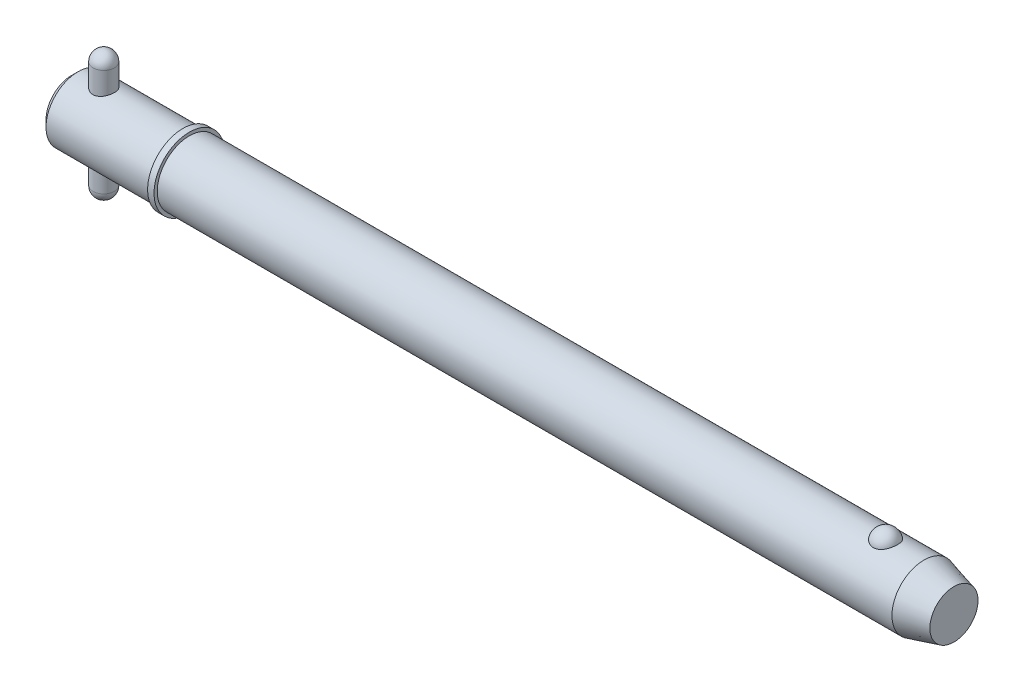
ISO-10303-21;
HEADER;
FILE_DESCRIPTION(('STEP AP214'),'2;1');
FILE_NAME('part.step','',(''),(''),'','','');
FILE_SCHEMA(('AUTOMOTIVE_DESIGN { 1 0 10303 214 1 1 1 1 }'));
ENDSEC;
DATA;
#1=APPLICATION_CONTEXT('core data for automotive mechanical design processes');
#2=APPLICATION_PROTOCOL_DEFINITION('international standard','automotive_design',2000,#1);
#3=PRODUCT_CONTEXT('',#1,'mechanical');
#4=PRODUCT('Part','Part','',(#3));
#5=PRODUCT_RELATED_PRODUCT_CATEGORY('part','',(#4));
#6=PRODUCT_DEFINITION_FORMATION('','',#4);
#7=PRODUCT_DEFINITION_CONTEXT('part definition',#1,'design');
#8=PRODUCT_DEFINITION('design','',#6,#7);
#9=PRODUCT_DEFINITION_SHAPE('','',#8);
#10=(LENGTH_UNIT() NAMED_UNIT(*) SI_UNIT(.MILLI.,.METRE.));
#11=(NAMED_UNIT(*) PLANE_ANGLE_UNIT() SI_UNIT($,.RADIAN.));
#12=(NAMED_UNIT(*) SI_UNIT($,.STERADIAN.) SOLID_ANGLE_UNIT());
#13=UNCERTAINTY_MEASURE_WITH_UNIT(LENGTH_MEASURE(1.E-05),#10,'distance_accuracy_value','');
#14=(GEOMETRIC_REPRESENTATION_CONTEXT(3) GLOBAL_UNCERTAINTY_ASSIGNED_CONTEXT((#13)) GLOBAL_UNIT_ASSIGNED_CONTEXT((#10,
#11,#12)) REPRESENTATION_CONTEXT('',''));
#15=CARTESIAN_POINT('',(0.,0.,0.));
#16=DIRECTION('',(0.,0.,1.));
#17=DIRECTION('',(1.,0.,0.));
#18=AXIS2_PLACEMENT_3D('',#15,#16,#17);
#19=CARTESIAN_POINT('',(9.525,19.05,0.));
#20=DIRECTION('',(0.,-1.,0.));
#21=DIRECTION('',(0.,0.,-1.));
#22=AXIS2_PLACEMENT_3D('',#19,#20,#21);
#23=CYLINDRICAL_SURFACE('',#22,3.175);
#24=CARTESIAN_POINT('',(9.525,-15.875,0.));
#25=DIRECTION('',(0.,-1.,0.));
#26=DIRECTION('',(0.,0.,-1.));
#27=AXIS2_PLACEMENT_3D('',#24,#25,#26);
#28=CIRCLE('',#27,3.175);
#29=CARTESIAN_POINT('',(9.525,-15.875,-3.175));
#30=VERTEX_POINT('',#29);
#31=EDGE_CURVE('P0_E10',#30,#30,#28,.F.);
#32=CARTESIAN_POINT('',(9.525,15.875,0.));
#33=DIRECTION('',(0.,-1.,0.));
#34=DIRECTION('',(0.,0.,-1.));
#35=AXIS2_PLACEMENT_3D('',#32,#33,#34);
#36=CIRCLE('',#35,3.175);
#37=CARTESIAN_POINT('',(9.525,15.875,-3.175));
#38=VERTEX_POINT('',#37);
#39=EDGE_CURVE('P0_E21',#38,#38,#36,.T.);
#40=CARTESIAN_POINT('',(9.525,-15.875,-3.175));
#41=CARTESIAN_POINT('',(9.525,-15.5442708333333,-3.175));
#42=CARTESIAN_POINT('',(9.525,-15.2135416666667,-3.175));
#43=CARTESIAN_POINT('',(9.525,-14.5520833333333,-3.175));
#44=CARTESIAN_POINT('',(9.525,-14.2213541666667,-3.175));
#45=CARTESIAN_POINT('',(9.525,-13.5598958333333,-3.175));
#46=CARTESIAN_POINT('',(9.525,-13.2291666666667,-3.175));
#47=CARTESIAN_POINT('',(9.525,-12.5677083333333,-3.175));
#48=CARTESIAN_POINT('',(9.525,-12.2369791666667,-3.175));
#49=CARTESIAN_POINT('',(9.525,-11.5755208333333,-3.175));
#50=CARTESIAN_POINT('',(9.525,-11.2447916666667,-3.175));
#51=CARTESIAN_POINT('',(9.525,-10.5833333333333,-3.175));
#52=CARTESIAN_POINT('',(9.525,-10.2526041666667,-3.175));
#53=CARTESIAN_POINT('',(9.525,-9.59114583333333,-3.175));
#54=CARTESIAN_POINT('',(9.525,-9.26041666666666,-3.175));
#55=CARTESIAN_POINT('',(9.525,-8.59895833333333,-3.175));
#56=CARTESIAN_POINT('',(9.525,-8.26822916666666,-3.175));
#57=CARTESIAN_POINT('',(9.525,-7.60677083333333,-3.175));
#58=CARTESIAN_POINT('',(9.525,-7.27604166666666,-3.175));
#59=CARTESIAN_POINT('',(9.525,-6.61458333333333,-3.175));
#60=CARTESIAN_POINT('',(9.525,-6.28385416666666,-3.175));
#61=CARTESIAN_POINT('',(9.525,-5.62239583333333,-3.175));
#62=CARTESIAN_POINT('',(9.525,-5.29166666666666,-3.175));
#63=CARTESIAN_POINT('',(9.525,-4.63020833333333,-3.175));
#64=CARTESIAN_POINT('',(9.525,-4.29947916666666,-3.175));
#65=CARTESIAN_POINT('',(9.525,-3.63802083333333,-3.175));
#66=CARTESIAN_POINT('',(9.525,-3.30729166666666,-3.175));
#67=CARTESIAN_POINT('',(9.525,-2.64583333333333,-3.175));
#68=CARTESIAN_POINT('',(9.525,-2.31510416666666,-3.175));
#69=CARTESIAN_POINT('',(9.525,-1.65364583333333,-3.175));
#70=CARTESIAN_POINT('',(9.525,-1.32291666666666,-3.175));
#71=CARTESIAN_POINT('',(9.525,-0.661458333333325,-3.175));
#72=CARTESIAN_POINT('',(9.525,-0.330729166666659,-3.175));
#73=CARTESIAN_POINT('',(9.525,0.330729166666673,-3.175));
#74=CARTESIAN_POINT('',(9.525,0.661458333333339,-3.175));
#75=CARTESIAN_POINT('',(9.525,1.32291666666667,-3.175));
#76=CARTESIAN_POINT('',(9.525,1.65364583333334,-3.175));
#77=CARTESIAN_POINT('',(9.525,2.31510416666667,-3.175));
#78=CARTESIAN_POINT('',(9.525,2.64583333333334,-3.175));
#79=CARTESIAN_POINT('',(9.525,3.30729166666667,-3.175));
#80=CARTESIAN_POINT('',(9.525,3.63802083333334,-3.175));
#81=CARTESIAN_POINT('',(9.525,4.29947916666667,-3.175));
#82=CARTESIAN_POINT('',(9.525,4.63020833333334,-3.175));
#83=CARTESIAN_POINT('',(9.525,5.29166666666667,-3.175));
#84=CARTESIAN_POINT('',(9.525,5.62239583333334,-3.175));
#85=CARTESIAN_POINT('',(9.525,6.28385416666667,-3.175));
#86=CARTESIAN_POINT('',(9.525,6.61458333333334,-3.175));
#87=CARTESIAN_POINT('',(9.525,7.27604166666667,-3.175));
#88=CARTESIAN_POINT('',(9.525,7.60677083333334,-3.175));
#89=CARTESIAN_POINT('',(9.525,8.26822916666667,-3.175));
#90=CARTESIAN_POINT('',(9.525,8.59895833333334,-3.175));
#91=CARTESIAN_POINT('',(9.525,9.26041666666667,-3.175));
#92=CARTESIAN_POINT('',(9.525,9.59114583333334,-3.175));
#93=CARTESIAN_POINT('',(9.525,10.2526041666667,-3.175));
#94=CARTESIAN_POINT('',(9.525,10.5833333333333,-3.175));
#95=CARTESIAN_POINT('',(9.525,11.2447916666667,-3.175));
#96=CARTESIAN_POINT('',(9.525,11.5755208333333,-3.175));
#97=CARTESIAN_POINT('',(9.525,12.2369791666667,-3.175));
#98=CARTESIAN_POINT('',(9.525,12.5677083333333,-3.175));
#99=CARTESIAN_POINT('',(9.525,13.2291666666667,-3.175));
#100=CARTESIAN_POINT('',(9.525,13.5598958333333,-3.175));
#101=CARTESIAN_POINT('',(9.525,14.2213541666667,-3.175));
#102=CARTESIAN_POINT('',(9.525,14.5520833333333,-3.175));
#103=CARTESIAN_POINT('',(9.525,15.2135416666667,-3.175));
#104=CARTESIAN_POINT('',(9.525,15.5442708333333,-3.175));
#105=CARTESIAN_POINT('',(9.525,15.875,-3.175));
#106=B_SPLINE_CURVE_WITH_KNOTS('',3,(#40,#41,#42,#43,#44,#45,#46,#47,#48,#49,#50,#51,#52,#53,
#54,#55,#56,#57,#58,#59,#60,#61,#62,#63,#64,#65,#66,#67,#68,#69,#70,#71,#72,#73,#74,#75,#76,#77,
#78,#79,#80,#81,#82,#83,#84,#85,#86,#87,#88,#89,#90,#91,#92,#93,#94,#95,#96,#97,#98,#99,#100,
#101,#102,#103,#104,#105),.UNSPECIFIED.,.F.,.F.,(4,2,2,2,2,2,2,2,2,2,2,2,2,2,2,2,2,2,2,2,2,2,2,
2,2,2,2,2,2,2,2,2,4),(0.,0.992187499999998,1.984375,2.9765625,3.96875,4.96093749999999,5.953125,
6.9453125,7.9375,8.92968749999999,9.921875,10.9140625,11.90625,12.8984375,13.890625,14.8828125,
15.875,16.8671875,17.859375,18.8515625,19.84375,20.8359375,21.828125,22.8203125,23.8125,
24.8046875,25.796875,26.7890625,27.78125,28.7734375,29.765625,30.7578125,31.75),.UNSPECIFIED.);
#107=EDGE_CURVE('P0_BSEAM14',#30,#38,#106,.T.);
#108=ORIENTED_EDGE('',*,*,#31,.T.);
#109=ORIENTED_EDGE('',*,*,#39,.T.);
#110=ORIENTED_EDGE('',*,*,#107,.T.);
#111=ORIENTED_EDGE('',*,*,#107,.F.);
#112=EDGE_LOOP('',(#108,#110,#109,#111));
#113=FACE_BOUND('',#112,.T.);
#114=ADVANCED_FACE('P0_F14',(#113),#23,.T.);
#115=CARTESIAN_POINT('',(9.525,-15.875,0.));
#116=DIRECTION('',(0.,0.,1.));
#117=DIRECTION('',(1.,0.,0.));
#118=AXIS2_PLACEMENT_3D('',#115,#116,#117);
#119=SPHERICAL_SURFACE('',#118,3.175);
#120=CARTESIAN_POINT('',(9.525,-15.875,0.));
#121=DIRECTION('',(0.,-1.,0.));
#122=DIRECTION('',(0.,0.,-1.));
#123=AXIS2_PLACEMENT_3D('',#120,#121,#122);
#124=SPHERICAL_SURFACE('',#123,3.175);
#125=ORIENTED_EDGE('',*,*,#31,.F.);
#126=EDGE_LOOP('',(#125));
#127=FACE_BOUND('',#126,.T.);
#128=ADVANCED_FACE('P0_F29',(#127),#124,.T.);
#129=CARTESIAN_POINT('',(9.525,15.875,0.));
#130=DIRECTION('',(0.,0.,1.));
#131=DIRECTION('',(1.,0.,0.));
#132=AXIS2_PLACEMENT_3D('',#129,#130,#131);
#133=SPHERICAL_SURFACE('',#132,3.175);
#134=CARTESIAN_POINT('',(9.525,15.875,0.));
#135=DIRECTION('',(0.,-1.,0.));
#136=DIRECTION('',(0.,0.,-1.));
#137=AXIS2_PLACEMENT_3D('',#134,#135,#136);
#138=SPHERICAL_SURFACE('',#137,3.175);
#139=ORIENTED_EDGE('',*,*,#39,.F.);
#140=EDGE_LOOP('',(#139));
#141=FACE_BOUND('',#140,.T.);
#142=ADVANCED_FACE('P0_F16',(#141),#138,.T.);
#143=CLOSED_SHELL('',(#114,#128,#142));
#144=MANIFOLD_SOLID_BREP('P0_B1',#143);
#145=CARTESIAN_POINT('',(0.,0.,0.));
#146=DIRECTION('',(1.,0.,0.));
#147=DIRECTION('',(0.,0.,-1.));
#148=AXIS2_PLACEMENT_3D('',#145,#146,#147);
#149=CYLINDRICAL_SURFACE('',#148,9.525);
#150=CARTESIAN_POINT('',(253.043054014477,0.,0.));
#151=DIRECTION('',(1.,0.,0.));
#152=DIRECTION('',(0.,0.,-1.));
#153=AXIS2_PLACEMENT_3D('',#150,#151,#152);
#154=CIRCLE('',#153,9.525);
#155=CARTESIAN_POINT('',(253.043054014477,0.,-9.525));
#156=VERTEX_POINT('',#155);
#157=EDGE_CURVE('P1_E81',#156,#156,#154,.T.);
#158=ORIENTED_EDGE('',*,*,#157,.F.);
#159=EDGE_LOOP('',(#158));
#160=FACE_BOUND('',#159,.T.);
#161=CARTESIAN_POINT('',(34.93,0.,0.));
#162=DIRECTION('',(1.,0.,0.));
#163=DIRECTION('',(0.,0.,-1.));
#164=AXIS2_PLACEMENT_3D('',#161,#162,#163);
#165=CIRCLE('',#164,9.525);
#166=CARTESIAN_POINT('',(34.93,0.,-9.525));
#167=VERTEX_POINT('',#166);
#168=EDGE_CURVE('P1_E85',#167,#167,#165,.T.);
#169=ORIENTED_EDGE('',*,*,#168,.T.);
#170=EDGE_LOOP('',(#169));
#171=FACE_BOUND('',#170,.T.);
#172=CARTESIAN_POINT('',(241.645757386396,8.80405803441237,3.63513233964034));
#173=CARTESIAN_POINT('',(241.551676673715,8.80405953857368,3.63513053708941));
#174=CARTESIAN_POINT('',(241.457561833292,8.80561325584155,3.63137461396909));
#175=CARTESIAN_POINT('',(241.270012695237,8.81177748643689,3.61638665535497));
#176=CARTESIAN_POINT('',(241.176578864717,8.81638992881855,3.60514990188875));
#177=CARTESIAN_POINT('',(240.897945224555,8.83467114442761,3.56024627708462));
#178=CARTESIAN_POINT('',(240.714691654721,8.85278327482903,3.51538626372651));
#179=CARTESIAN_POINT('',(240.359509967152,8.89871214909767,3.39742145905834));
#180=CARTESIAN_POINT('',(240.187553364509,8.92650327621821,3.32439116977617));
#181=CARTESIAN_POINT('',(239.858707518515,8.98874819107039,3.15220244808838));
#182=CARTESIAN_POINT('',(239.701811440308,9.02319893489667,3.05305594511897));
#183=CARTESIAN_POINT('',(239.402214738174,9.09629186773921,2.82797815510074));
#184=CARTESIAN_POINT('',(239.260060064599,9.13502685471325,2.70135138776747));
#185=CARTESIAN_POINT('',(238.998299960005,9.21186572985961,2.42641932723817));
#186=CARTESIAN_POINT('',(238.878701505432,9.24996941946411,2.2781073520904));
#187=CARTESIAN_POINT('',(238.659645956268,9.32341082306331,1.95652290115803));
#188=CARTESIAN_POINT('',(238.561317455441,9.35855090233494,1.78243511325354));
#189=CARTESIAN_POINT('',(238.393819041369,9.42045142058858,1.41937246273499));
#190=CARTESIAN_POINT('',(238.324651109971,9.44721128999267,1.23039658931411));
#191=CARTESIAN_POINT('',(238.216199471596,9.48990641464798,0.84037088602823));
#192=CARTESIAN_POINT('',(238.177288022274,9.50570658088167,0.639202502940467));
#193=CARTESIAN_POINT('',(238.131555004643,9.52433146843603,0.232664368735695));
#194=CARTESIAN_POINT('',(238.124732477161,9.52715657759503,0.0272947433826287));
#195=CARTESIAN_POINT('',(238.143255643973,9.51956918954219,-0.380478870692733));
#196=CARTESIAN_POINT('',(238.168405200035,9.50923740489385,-0.582893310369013));
#197=CARTESIAN_POINT('',(238.25002537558,9.47651897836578,-0.98029399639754));
#198=CARTESIAN_POINT('',(238.306496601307,9.45413210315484,-1.17528009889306));
#199=CARTESIAN_POINT('',(238.449719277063,9.39954044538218,-1.55263697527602));
#200=CARTESIAN_POINT('',(238.536512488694,9.36732213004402,-1.73498993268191));
#201=CARTESIAN_POINT('',(238.738610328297,9.29640700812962,-2.08177763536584));
#202=CARTESIAN_POINT('',(238.853917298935,9.25770966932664,-2.24621090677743));
#203=CARTESIAN_POINT('',(239.111264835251,9.17775604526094,-2.5533833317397));
#204=CARTESIAN_POINT('',(239.253434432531,9.136488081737,-2.696011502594));
#205=CARTESIAN_POINT('',(239.56089985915,9.05620497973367,-2.95451229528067));
#206=CARTESIAN_POINT('',(239.726193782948,9.01718965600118,-3.07038711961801));
#207=CARTESIAN_POINT('',(240.072052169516,8.94680019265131,-3.26976836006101));
#208=CARTESIAN_POINT('',(240.252227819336,8.91528408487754,-3.35389750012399));
#209=CARTESIAN_POINT('',(240.625651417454,8.86272514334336,-3.49043503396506));
#210=CARTESIAN_POINT('',(240.818894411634,8.84167836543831,-3.54285537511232));
#211=CARTESIAN_POINT('',(241.202503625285,8.81348056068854,-3.61241306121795));
#212=CARTESIAN_POINT('',(241.392525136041,8.80568348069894,-3.6311933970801));
#213=CARTESIAN_POINT('',(241.773190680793,8.80289410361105,-3.63795342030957));
#214=CARTESIAN_POINT('',(241.963834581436,8.80789922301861,-3.62593932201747));
#215=CARTESIAN_POINT('',(242.334007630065,8.82974915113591,-3.57238430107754));
#216=CARTESIAN_POINT('',(242.513697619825,8.84621463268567,-3.53178890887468));
#217=CARTESIAN_POINT('',(242.863422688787,8.88875330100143,-3.42331083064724));
#218=CARTESIAN_POINT('',(243.033456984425,8.91482726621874,-3.35542593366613));
#219=CARTESIAN_POINT('',(243.363237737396,8.97448239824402,-3.19248225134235));
#220=CARTESIAN_POINT('',(243.522680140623,9.00821446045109,-3.0968647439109));
#221=CARTESIAN_POINT('',(243.823513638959,9.07935398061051,-2.88162736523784));
#222=CARTESIAN_POINT('',(243.964900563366,9.11676228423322,-2.76200196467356));
#223=CARTESIAN_POINT('',(244.23331931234,9.19347419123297,-2.49516285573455));
#224=CARTESIAN_POINT('',(244.359275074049,9.23277872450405,-2.34686614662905));
#225=CARTESIAN_POINT('',(244.585522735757,9.3073761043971,-2.03093683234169));
#226=CARTESIAN_POINT('',(244.68581004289,9.34266823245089,-1.86330077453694));
#227=CARTESIAN_POINT('',(244.861514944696,9.40674710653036,-1.50744893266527));
#228=CARTESIAN_POINT('',(244.936041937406,9.43529176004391,-1.31874876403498));
#229=CARTESIAN_POINT('',(245.05416505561,9.48144132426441,-0.930631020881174));
#230=CARTESIAN_POINT('',(245.097760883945,9.49904612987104,-0.731213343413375));
#231=CARTESIAN_POINT('',(245.153158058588,9.5215314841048,-0.327147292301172));
#232=CARTESIAN_POINT('',(245.164935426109,9.52640243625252,-0.122495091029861));
#233=CARTESIAN_POINT('',(245.156382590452,9.5228957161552,0.28601848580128));
#234=CARTESIAN_POINT('',(245.13605305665,9.5145183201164,0.489879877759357));
#235=CARTESIAN_POINT('',(245.063884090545,9.48544083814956,0.889994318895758));
#236=CARTESIAN_POINT('',(245.012199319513,9.46480124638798,1.08627971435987));
#237=CARTESIAN_POINT('',(244.878491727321,9.4133389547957,1.46682086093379));
#238=CARTESIAN_POINT('',(244.796466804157,9.38251554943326,1.65107577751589));
#239=CARTESIAN_POINT('',(244.60319292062,9.31365636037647,2.00346348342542));
#240=CARTESIAN_POINT('',(244.491783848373,9.27558138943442,2.17150083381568));
#241=CARTESIAN_POINT('',(244.242294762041,9.19638714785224,2.48563115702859));
#242=CARTESIAN_POINT('',(244.104216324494,9.15526805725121,2.63172542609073));
#243=CARTESIAN_POINT('',(243.804843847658,9.07465393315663,2.89750997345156));
#244=CARTESIAN_POINT('',(243.643610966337,9.03515496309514,3.01726776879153));
#245=CARTESIAN_POINT('',(243.301613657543,8.96227564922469,3.22732920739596));
#246=CARTESIAN_POINT('',(243.120841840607,8.92889763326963,3.31762165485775));
#247=CARTESIAN_POINT('',(242.751445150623,8.8734538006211,3.46314419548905));
#248=CARTESIAN_POINT('',(242.56332371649,8.85102983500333,3.51950082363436));
#249=CARTESIAN_POINT('',(242.27578699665,8.82666967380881,3.57993683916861));
#250=CARTESIAN_POINT('',(242.179133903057,8.82009725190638,3.59606217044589));
#251=CARTESIAN_POINT('',(241.984677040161,8.81020897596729,3.62022512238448));
#252=CARTESIAN_POINT('',(241.886874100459,8.80689090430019,3.62826825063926));
#253=CARTESIAN_POINT('',(241.741224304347,8.80445615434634,3.63416760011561));
#254=CARTESIAN_POINT('',(241.693495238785,8.80405727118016,3.63513325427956));
#255=CARTESIAN_POINT('',(241.645757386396,8.80405803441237,3.63513233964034));
#256=B_SPLINE_CURVE_WITH_KNOTS('',3,(#172,#173,#174,#175,#176,#177,#178,#179,#180,#181,#182,
#183,#184,#185,#186,#187,#188,#189,#190,#191,#192,#193,#194,#195,#196,#197,#198,#199,#200,#201,
#202,#203,#204,#205,#206,#207,#208,#209,#210,#211,#212,#213,#214,#215,#216,#217,#218,#219,#220,
#221,#222,#223,#224,#225,#226,#227,#228,#229,#230,#231,#232,#233,#234,#235,#236,#237,#238,#239,
#240,#241,#242,#243,#244,#245,#246,#247,#248,#249,#250,#251,#252,#253,#254,#255),.UNSPECIFIED.,
.T.,.F.,(4,2,2,2,2,2,2,2,2,2,2,2,2,2,2,2,2,2,2,2,2,2,2,2,2,2,2,2,2,2,2,2,2,2,2,2,2,2,2,2,2,4),
(0.,0.282202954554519,0.564584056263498,1.13017050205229,1.69427128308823,2.25811483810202,
2.83836627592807,3.41879688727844,4.02497117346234,4.63118665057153,5.24474754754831,
5.85829010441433,6.46808687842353,7.07789545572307,7.68854723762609,8.299249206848,
8.91296283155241,9.52662591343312,10.1275338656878,10.7282152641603,11.2986646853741,
11.8689989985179,12.4213015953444,12.973648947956,13.5380053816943,14.1024919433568,
14.695298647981,15.2882113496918,15.8999469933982,16.5116885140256,17.1238909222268,
17.7360805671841,18.3452748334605,18.9545113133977,19.567138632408,20.179729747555,
20.7907316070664,21.4019653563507,21.9915938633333,22.2859053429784,22.5800161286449,
22.7232098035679),.UNSPECIFIED.);
#257=CARTESIAN_POINT('',(241.645757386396,8.80405803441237,3.63513233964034));
#258=VERTEX_POINT('',#257);
#259=EDGE_CURVE('P1_E35',#258,#258,#256,.T.);
#260=ORIENTED_EDGE('',*,*,#259,.T.);
#261=EDGE_LOOP('',(#260));
#262=FACE_BOUND('',#261,.T.);
#263=ADVANCED_FACE('P1_F13',(#160,#171,#262),#149,.T.);
#264=CARTESIAN_POINT('',(0.,0.,0.));
#265=DIRECTION('',(-1.,0.,0.));
#266=DIRECTION('',(0.,0.,1.));
#267=AXIS2_PLACEMENT_3D('',#264,#265,#266);
#268=PLANE('',#267);
#269=CARTESIAN_POINT('',(0.,0.,0.));
#270=DIRECTION('',(1.,0.,0.));
#271=DIRECTION('',(0.,0.,-1.));
#272=AXIS2_PLACEMENT_3D('',#269,#270,#271);
#273=CIRCLE('',#272,7.62);
#274=CARTESIAN_POINT('',(0.,0.,-7.62));
#275=VERTEX_POINT('',#274);
#276=EDGE_CURVE('P1_E9',#275,#275,#273,.T.);
#277=ORIENTED_EDGE('',*,*,#276,.F.);
#278=EDGE_LOOP('',(#277));
#279=FACE_BOUND('',#278,.T.);
#280=ADVANCED_FACE('P1_F15',(#279),#268,.T.);
#281=CARTESIAN_POINT('',(1.90499999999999,0.,0.));
#282=DIRECTION('',(1.,0.,0.));
#283=DIRECTION('',(0.,0.,-1.));
#284=AXIS2_PLACEMENT_3D('',#281,#282,#283);
#285=CONICAL_SURFACE('',#284,9.525,0.785398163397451);
#286=ORIENTED_EDGE('',*,*,#276,.T.);
#287=EDGE_LOOP('',(#286));
#288=FACE_BOUND('',#287,.T.);
#289=CARTESIAN_POINT('',(1.90499999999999,0.,0.));
#290=DIRECTION('',(1.,0.,0.));
#291=DIRECTION('',(0.,0.,-1.));
#292=AXIS2_PLACEMENT_3D('',#289,#290,#291);
#293=CIRCLE('',#292,9.525);
#294=CARTESIAN_POINT('',(1.90499999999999,0.,-9.525));
#295=VERTEX_POINT('',#294);
#296=EDGE_CURVE('P1_E26',#295,#295,#293,.T.);
#297=ORIENTED_EDGE('',*,*,#296,.F.);
#298=EDGE_LOOP('',(#297));
#299=FACE_BOUND('',#298,.T.);
#300=ADVANCED_FACE('P1_F77',(#288,#299),#285,.T.);
#301=CARTESIAN_POINT('',(0.,0.,0.));
#302=DIRECTION('',(1.,0.,0.));
#303=DIRECTION('',(0.,0.,-1.));
#304=AXIS2_PLACEMENT_3D('',#301,#302,#303);
#305=CYLINDRICAL_SURFACE('',#304,9.525);
#306=CARTESIAN_POINT('',(9.525,-8.98025612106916,3.175));
#307=CARTESIAN_POINT('',(9.35206354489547,-8.98025555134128,3.17500081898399));
#308=CARTESIAN_POINT('',(9.17913201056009,-8.98530617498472,3.16082293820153));
#309=CARTESIAN_POINT('',(8.83839221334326,-9.00485797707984,3.10467734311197));
#310=CARTESIAN_POINT('',(8.67058479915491,-9.0193607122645,3.06270505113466));
#311=CARTESIAN_POINT('',(8.34508461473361,-9.05599546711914,2.95260866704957));
#312=CARTESIAN_POINT('',(8.18737272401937,-9.07811252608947,2.88453582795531));
#313=CARTESIAN_POINT('',(7.88555684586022,-9.12746212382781,2.72434567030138));
#314=CARTESIAN_POINT('',(7.74145587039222,-9.1546957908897,2.63222304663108));
#315=CARTESIAN_POINT('',(7.46531411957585,-9.21240503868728,2.42268738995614));
#316=CARTESIAN_POINT('',(7.33388351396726,-9.24296141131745,2.30449228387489));
#317=CARTESIAN_POINT('',(7.09229340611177,-9.30319020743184,2.0478358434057));
#318=CARTESIAN_POINT('',(6.98213731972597,-9.33286248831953,1.90937126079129));
#319=CARTESIAN_POINT('',(6.78345450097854,-9.38891527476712,1.61164431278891));
#320=CARTESIAN_POINT('',(6.69556709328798,-9.41518969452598,1.45193356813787));
#321=CARTESIAN_POINT('',(6.54814671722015,-9.46053437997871,1.11896913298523));
#322=CARTESIAN_POINT('',(6.48860610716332,-9.47960658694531,0.945719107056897));
#323=CARTESIAN_POINT('',(6.40163866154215,-9.50782564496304,0.596991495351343));
#324=CARTESIAN_POINT('',(6.373166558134,-9.5172947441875,0.421801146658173));
#325=CARTESIAN_POINT('',(6.3458207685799,-9.52638456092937,0.068890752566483));
#326=CARTESIAN_POINT('',(6.34693945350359,-9.52600781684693,-0.108828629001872));
#327=CARTESIAN_POINT('',(6.37808050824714,-9.51566675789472,-0.454353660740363));
#328=CARTESIAN_POINT('',(6.4069675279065,-9.50607905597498,-0.622274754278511));
#329=CARTESIAN_POINT('',(6.490947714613,-9.47886621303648,-0.950732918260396));
#330=CARTESIAN_POINT('',(6.54604265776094,-9.46124052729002,-1.11126948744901));
#331=CARTESIAN_POINT('',(6.68153768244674,-9.41945253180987,-1.42288410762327));
#332=CARTESIAN_POINT('',(6.76226085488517,-9.3952073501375,-1.57381010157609));
#333=CARTESIAN_POINT('',(6.94645456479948,-9.34270397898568,-1.86030973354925));
#334=CARTESIAN_POINT('',(7.04993142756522,-9.31444467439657,-1.99587908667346));
#335=CARTESIAN_POINT('',(7.28241619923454,-9.25532159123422,-2.2545702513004));
#336=CARTESIAN_POINT('',(7.4123967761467,-9.22439783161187,-2.37680549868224));
#337=CARTESIAN_POINT('',(7.69127470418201,-9.1645528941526,-2.5980302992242));
#338=CARTESIAN_POINT('',(7.84017496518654,-9.13563202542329,-2.6970162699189));
#339=CARTESIAN_POINT('',(8.15547526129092,-9.08273917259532,-2.87016016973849));
#340=CARTESIAN_POINT('',(8.32209451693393,-9.05884361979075,-2.94394402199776));
#341=CARTESIAN_POINT('',(8.66638917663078,-9.01959241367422,-3.06210713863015));
#342=CARTESIAN_POINT('',(8.84405991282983,-9.00423318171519,-3.10649872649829));
#343=CARTESIAN_POINT('',(9.19682677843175,-8.98460345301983,-3.16281207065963));
#344=CARTESIAN_POINT('',(9.37167742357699,-8.9798639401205,-3.17610837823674));
#345=CARTESIAN_POINT('',(9.72113927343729,-8.9806993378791,-3.17374726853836));
#346=CARTESIAN_POINT('',(9.89575051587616,-8.98627237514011,-3.15809511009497));
#347=CARTESIAN_POINT('',(10.2335233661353,-9.00663737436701,-3.09951644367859));
#348=CARTESIAN_POINT('',(10.3968722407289,-9.02110608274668,-3.05754530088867));
#349=CARTESIAN_POINT('',(10.7141759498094,-9.05727657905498,-2.94866651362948));
#350=CARTESIAN_POINT('',(10.8681291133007,-9.07897964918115,-2.88175444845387));
#351=CARTESIAN_POINT('',(11.1676828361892,-9.12802586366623,-2.72248103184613));
#352=CARTESIAN_POINT('',(11.3128635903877,-9.1555260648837,-2.62937980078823));
#353=CARTESIAN_POINT('',(11.5860387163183,-9.21276315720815,-2.42120937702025));
#354=CARTESIAN_POINT('',(11.7140280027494,-9.24250070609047,-2.30613370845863));
#355=CARTESIAN_POINT('',(11.9555513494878,-9.30259247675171,-2.05070616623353));
#356=CARTESIAN_POINT('',(12.0680936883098,-9.33290753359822,-1.90940458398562));
#357=CARTESIAN_POINT('',(12.267933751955,-9.3893275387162,-1.60917665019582));
#358=CARTESIAN_POINT('',(12.3552323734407,-9.41543263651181,-1.45025092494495));
#359=CARTESIAN_POINT('',(12.5013088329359,-9.46036988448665,-1.12007606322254));
#360=CARTESIAN_POINT('',(12.5602723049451,-9.47924920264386,-0.9489158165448));
#361=CARTESIAN_POINT('',(12.6483355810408,-9.50781089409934,-0.598355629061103));
#362=CARTESIAN_POINT('',(12.6774461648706,-9.5174965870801,-0.4189586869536));
#363=CARTESIAN_POINT('',(12.7040070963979,-9.52632915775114,-0.066088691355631));
#364=CARTESIAN_POINT('',(12.7028811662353,-9.52594996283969,0.107266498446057));
#365=CARTESIAN_POINT('',(12.6725130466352,-9.51586223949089,0.451202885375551));
#366=CARTESIAN_POINT('',(12.643273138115,-9.50615446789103,0.621784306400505));
#367=CARTESIAN_POINT('',(12.5584514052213,-9.47867404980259,0.952633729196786));
#368=CARTESIAN_POINT('',(12.5032953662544,-9.46103195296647,1.1130225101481));
#369=CARTESIAN_POINT('',(12.3686013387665,-9.41949985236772,1.42233126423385));
#370=CARTESIAN_POINT('',(12.2890589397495,-9.39560871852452,1.57124915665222));
#371=CARTESIAN_POINT('',(12.1044667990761,-9.34294133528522,1.85938800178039));
#372=CARTESIAN_POINT('',(11.9985831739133,-9.31401720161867,1.9980473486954));
#373=CARTESIAN_POINT('',(11.7657327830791,-9.25490239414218,2.25609475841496));
#374=CARTESIAN_POINT('',(11.6387592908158,-9.22471131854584,2.37547664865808));
#375=CARTESIAN_POINT('',(11.3613902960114,-9.16505913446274,2.59633024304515));
#376=CARTESIAN_POINT('',(11.2102725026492,-9.13567286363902,2.69691791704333));
#377=CARTESIAN_POINT('',(10.8923631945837,-9.08241113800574,2.87119803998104));
#378=CARTESIAN_POINT('',(10.7255757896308,-9.05853424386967,2.94489751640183));
#379=CARTESIAN_POINT('',(10.3887212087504,-9.02021736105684,3.06020415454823));
#380=CARTESIAN_POINT('',(10.219143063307,-9.00539959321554,3.10311136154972));
#381=CARTESIAN_POINT('',(9.87470703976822,-8.98542092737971,3.16050396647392));
#382=CARTESIAN_POINT('',(9.699851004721,-8.98025669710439,3.17499917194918));
#383=CARTESIAN_POINT('',(9.525,-8.98025612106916,3.175));
#384=B_SPLINE_CURVE_WITH_KNOTS('',3,(#306,#307,#308,#309,#310,#311,#312,#313,#314,#315,#316,
#317,#318,#319,#320,#321,#322,#323,#324,#325,#326,#327,#328,#329,#330,#331,#332,#333,#334,#335,
#336,#337,#338,#339,#340,#341,#342,#343,#344,#345,#346,#347,#348,#349,#350,#351,#352,#353,#354,
#355,#356,#357,#358,#359,#360,#361,#362,#363,#364,#365,#366,#367,#368,#369,#370,#371,#372,#373,
#374,#375,#376,#377,#378,#379,#380,#381,#382,#383),.UNSPECIFIED.,.T.,.F.,(4,2,2,2,2,2,2,2,2,2,2,
2,2,2,2,2,2,2,2,2,2,2,2,2,2,2,2,2,2,2,2,2,2,2,2,2,2,2,4),(0.,0.518161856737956,1.03640907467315,
1.55364379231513,2.07099270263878,2.60671746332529,3.14252816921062,3.69231882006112,
4.24196117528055,4.77247962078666,5.30286129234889,5.81244090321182,6.32205505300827,
6.83836754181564,7.3548237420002,7.89559553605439,8.43645060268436,8.98501631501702,
9.53335188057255,10.056948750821,10.5804505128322,11.0859695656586,11.5915782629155,
12.1132237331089,12.6350231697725,13.1819271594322,13.7288117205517,14.2720628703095,
14.815117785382,15.3326491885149,15.8501386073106,16.3594083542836,16.868770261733,
17.3969527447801,17.925304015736,18.4743376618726,19.023227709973,19.5473069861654,
20.0712053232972),.UNSPECIFIED.);
#385=CARTESIAN_POINT('',(9.525,-8.98025612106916,3.175));
#386=VERTEX_POINT('',#385);
#387=EDGE_CURVE('P1_E17',#386,#386,#384,.T.);
#388=ORIENTED_EDGE('',*,*,#387,.F.);
#389=EDGE_LOOP('',(#388));
#390=FACE_BOUND('',#389,.T.);
#391=CARTESIAN_POINT('',(9.525,8.98025612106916,3.175));
#392=CARTESIAN_POINT('',(9.69793645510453,8.98025555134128,3.17500081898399));
#393=CARTESIAN_POINT('',(9.87086798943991,8.98530617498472,3.16082293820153));
#394=CARTESIAN_POINT('',(10.2116077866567,9.00485797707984,3.10467734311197));
#395=CARTESIAN_POINT('',(10.3794152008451,9.0193607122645,3.06270505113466));
#396=CARTESIAN_POINT('',(10.7049153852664,9.05599546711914,2.95260866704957));
#397=CARTESIAN_POINT('',(10.8626272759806,9.07811252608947,2.88453582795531));
#398=CARTESIAN_POINT('',(11.1644431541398,9.12746212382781,2.72434567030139));
#399=CARTESIAN_POINT('',(11.3085441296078,9.15469579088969,2.63222304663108));
#400=CARTESIAN_POINT('',(11.5846858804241,9.21240503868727,2.42268738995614));
#401=CARTESIAN_POINT('',(11.7161164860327,9.24296141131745,2.30449228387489));
#402=CARTESIAN_POINT('',(11.9577065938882,9.30319020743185,2.0478358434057));
#403=CARTESIAN_POINT('',(12.067862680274,9.33286248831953,1.90937126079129));
#404=CARTESIAN_POINT('',(12.2665454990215,9.38891527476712,1.61164431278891));
#405=CARTESIAN_POINT('',(12.354432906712,9.41518969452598,1.45193356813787));
#406=CARTESIAN_POINT('',(12.5018532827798,9.46053437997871,1.11896913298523));
#407=CARTESIAN_POINT('',(12.5613938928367,9.47960658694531,0.945719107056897));
#408=CARTESIAN_POINT('',(12.6483613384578,9.50782564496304,0.596991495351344));
#409=CARTESIAN_POINT('',(12.676833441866,9.5172947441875,0.421801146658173));
#410=CARTESIAN_POINT('',(12.7041792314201,9.52638456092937,0.0688907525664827));
#411=CARTESIAN_POINT('',(12.7030605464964,9.52600781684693,-0.108828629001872));
#412=CARTESIAN_POINT('',(12.6719194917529,9.51566675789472,-0.454353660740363));
#413=CARTESIAN_POINT('',(12.6430324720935,9.50607905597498,-0.622274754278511));
#414=CARTESIAN_POINT('',(12.559052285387,9.47886621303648,-0.950732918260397));
#415=CARTESIAN_POINT('',(12.5039573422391,9.46124052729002,-1.11126948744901));
#416=CARTESIAN_POINT('',(12.3684623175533,9.41945253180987,-1.42288410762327));
#417=CARTESIAN_POINT('',(12.2877391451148,9.3952073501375,-1.57381010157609));
#418=CARTESIAN_POINT('',(12.1035454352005,9.34270397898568,-1.86030973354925));
#419=CARTESIAN_POINT('',(12.0000685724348,9.31444467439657,-1.99587908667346));
#420=CARTESIAN_POINT('',(11.7675838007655,9.25532159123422,-2.2545702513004));
#421=CARTESIAN_POINT('',(11.6376032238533,9.22439783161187,-2.37680549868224));
#422=CARTESIAN_POINT('',(11.358725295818,9.1645528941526,-2.5980302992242));
#423=CARTESIAN_POINT('',(11.2098250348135,9.13563202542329,-2.6970162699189));
#424=CARTESIAN_POINT('',(10.8945247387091,9.08273917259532,-2.87016016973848));
#425=CARTESIAN_POINT('',(10.7279054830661,9.05884361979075,-2.94394402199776));
#426=CARTESIAN_POINT('',(10.3836108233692,9.01959241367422,-3.06210713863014));
#427=CARTESIAN_POINT('',(10.2059400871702,9.00423318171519,-3.10649872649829));
#428=CARTESIAN_POINT('',(9.85317322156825,8.98460345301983,-3.16281207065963));
#429=CARTESIAN_POINT('',(9.67832257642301,8.9798639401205,-3.17610837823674));
#430=CARTESIAN_POINT('',(9.32886072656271,8.9806993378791,-3.17374726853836));
#431=CARTESIAN_POINT('',(9.15424948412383,8.98627237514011,-3.15809511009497));
#432=CARTESIAN_POINT('',(8.81647663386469,9.00663737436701,-3.09951644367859));
#433=CARTESIAN_POINT('',(8.65312775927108,9.02110608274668,-3.05754530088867));
#434=CARTESIAN_POINT('',(8.33582405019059,9.05727657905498,-2.94866651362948));
#435=CARTESIAN_POINT('',(8.18187088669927,9.07897964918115,-2.88175444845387));
#436=CARTESIAN_POINT('',(7.88231716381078,9.12802586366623,-2.72248103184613));
#437=CARTESIAN_POINT('',(7.73713640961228,9.1555260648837,-2.62937980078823));
#438=CARTESIAN_POINT('',(7.46396128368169,9.21276315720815,-2.42120937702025));
#439=CARTESIAN_POINT('',(7.33597199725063,9.24250070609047,-2.30613370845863));
#440=CARTESIAN_POINT('',(7.09444865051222,9.30259247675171,-2.05070616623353));
#441=CARTESIAN_POINT('',(6.98190631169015,9.33290753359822,-1.90940458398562));
#442=CARTESIAN_POINT('',(6.78206624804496,9.3893275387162,-1.60917665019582));
#443=CARTESIAN_POINT('',(6.6947676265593,9.41543263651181,-1.45025092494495));
#444=CARTESIAN_POINT('',(6.54869116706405,9.46036988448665,-1.12007606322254));
#445=CARTESIAN_POINT('',(6.48972769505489,9.47924920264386,-0.948915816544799));
#446=CARTESIAN_POINT('',(6.40166441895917,9.50781089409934,-0.598355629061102));
#447=CARTESIAN_POINT('',(6.3725538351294,9.5174965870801,-0.418958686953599));
#448=CARTESIAN_POINT('',(6.34599290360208,9.52632915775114,-0.0660886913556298));
#449=CARTESIAN_POINT('',(6.3471188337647,9.52594996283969,0.107266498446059));
#450=CARTESIAN_POINT('',(6.37748695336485,9.51586223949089,0.451202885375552));
#451=CARTESIAN_POINT('',(6.40672686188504,9.50615446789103,0.621784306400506));
#452=CARTESIAN_POINT('',(6.49154859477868,9.47867404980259,0.952633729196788));
#453=CARTESIAN_POINT('',(6.54670463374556,9.46103195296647,1.11302251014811));
#454=CARTESIAN_POINT('',(6.68139866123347,9.41949985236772,1.42233126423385));
#455=CARTESIAN_POINT('',(6.76094106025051,9.39560871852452,1.57124915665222));
#456=CARTESIAN_POINT('',(6.94553320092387,9.34294133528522,1.85938800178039));
#457=CARTESIAN_POINT('',(7.05141682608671,9.31401720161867,1.9980473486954));
#458=CARTESIAN_POINT('',(7.28426721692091,9.25490239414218,2.25609475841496));
#459=CARTESIAN_POINT('',(7.41124070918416,9.22471131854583,2.37547664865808));
#460=CARTESIAN_POINT('',(7.68860970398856,9.16505913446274,2.59633024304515));
#461=CARTESIAN_POINT('',(7.83972749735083,9.13567286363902,2.69691791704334));
#462=CARTESIAN_POINT('',(8.15763680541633,9.08241113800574,2.87119803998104));
#463=CARTESIAN_POINT('',(8.32442421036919,9.05853424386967,2.94489751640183));
#464=CARTESIAN_POINT('',(8.66127879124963,9.02021736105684,3.06020415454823));
#465=CARTESIAN_POINT('',(8.83085693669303,9.00539959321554,3.10311136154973));
#466=CARTESIAN_POINT('',(9.17529296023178,8.98542092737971,3.16050396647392));
#467=CARTESIAN_POINT('',(9.350148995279,8.98025669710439,3.17499917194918));
#468=CARTESIAN_POINT('',(9.525,8.98025612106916,3.175));
#469=B_SPLINE_CURVE_WITH_KNOTS('',3,(#391,#392,#393,#394,#395,#396,#397,#398,#399,#400,#401,
#402,#403,#404,#405,#406,#407,#408,#409,#410,#411,#412,#413,#414,#415,#416,#417,#418,#419,#420,
#421,#422,#423,#424,#425,#426,#427,#428,#429,#430,#431,#432,#433,#434,#435,#436,#437,#438,#439,
#440,#441,#442,#443,#444,#445,#446,#447,#448,#449,#450,#451,#452,#453,#454,#455,#456,#457,#458,
#459,#460,#461,#462,#463,#464,#465,#466,#467,#468),.UNSPECIFIED.,.T.,.F.,(4,2,2,2,2,2,2,2,2,2,2,
2,2,2,2,2,2,2,2,2,2,2,2,2,2,2,2,2,2,2,2,2,2,2,2,2,2,2,4),(0.,0.518161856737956,1.03640907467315,
1.55364379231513,2.07099270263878,2.60671746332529,3.14252816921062,3.69231882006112,
4.24196117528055,4.77247962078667,5.30286129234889,5.81244090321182,6.32205505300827,
6.83836754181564,7.3548237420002,7.89559553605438,8.43645060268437,8.98501631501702,
9.53335188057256,10.056948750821,10.5804505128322,11.0859695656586,11.5915782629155,
12.1132237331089,12.6350231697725,13.1819271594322,13.7288117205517,14.2720628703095,
14.815117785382,15.3326491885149,15.8501386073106,16.3594083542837,16.868770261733,
17.3969527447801,17.9253040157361,18.4743376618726,19.023227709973,19.5473069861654,
20.0712053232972),.UNSPECIFIED.);
#470=CARTESIAN_POINT('',(9.525,8.98025612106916,3.175));
#471=VERTEX_POINT('',#470);
#472=EDGE_CURVE('P1_E43',#471,#471,#469,.T.);
#473=ORIENTED_EDGE('',*,*,#472,.F.);
#474=EDGE_LOOP('',(#473));
#475=FACE_BOUND('',#474,.T.);
#476=ORIENTED_EDGE('',*,*,#296,.T.);
#477=EDGE_LOOP('',(#476));
#478=FACE_BOUND('',#477,.T.);
#479=CARTESIAN_POINT('',(33.025,0.,0.));
#480=DIRECTION('',(1.,0.,0.));
#481=DIRECTION('',(0.,0.,-1.));
#482=AXIS2_PLACEMENT_3D('',#479,#480,#481);
#483=CIRCLE('',#482,9.525);
#484=CARTESIAN_POINT('',(33.025,0.,-9.525));
#485=VERTEX_POINT('',#484);
#486=EDGE_CURVE('P1_E31',#485,#485,#483,.T.);
#487=ORIENTED_EDGE('',*,*,#486,.F.);
#488=EDGE_LOOP('',(#487));
#489=FACE_BOUND('',#488,.T.);
#490=ADVANCED_FACE('P1_F103',(#390,#475,#478,#489),#305,.T.);
#491=CARTESIAN_POINT('',(33.025,9.525,0.));
#492=DIRECTION('',(-1.,0.,0.));
#493=DIRECTION('',(0.,0.,1.));
#494=AXIS2_PLACEMENT_3D('',#491,#492,#493);
#495=PLANE('',#494);
#496=ORIENTED_EDGE('',*,*,#486,.T.);
#497=EDGE_LOOP('',(#496));
#498=FACE_BOUND('',#497,.T.);
#499=CARTESIAN_POINT('',(33.025,0.,0.));
#500=DIRECTION('',(1.,0.,0.));
#501=DIRECTION('',(0.,0.,-1.));
#502=AXIS2_PLACEMENT_3D('',#499,#500,#501);
#503=CIRCLE('',#502,10.4775);
#504=CARTESIAN_POINT('',(33.025,0.,-10.4775));
#505=VERTEX_POINT('',#504);
#506=EDGE_CURVE('P1_E91',#505,#505,#503,.T.);
#507=ORIENTED_EDGE('',*,*,#506,.F.);
#508=EDGE_LOOP('',(#507));
#509=FACE_BOUND('',#508,.T.);
#510=ADVANCED_FACE('P1_F100',(#498,#509),#495,.T.);
#511=CARTESIAN_POINT('',(0.,0.,0.));
#512=DIRECTION('',(1.,0.,0.));
#513=DIRECTION('',(0.,0.,-1.));
#514=AXIS2_PLACEMENT_3D('',#511,#512,#513);
#515=CYLINDRICAL_SURFACE('',#514,10.4775);
#516=ORIENTED_EDGE('',*,*,#506,.T.);
#517=EDGE_LOOP('',(#516));
#518=FACE_BOUND('',#517,.T.);
#519=CARTESIAN_POINT('',(34.93,0.,0.));
#520=DIRECTION('',(1.,0.,0.));
#521=DIRECTION('',(0.,0.,-1.));
#522=AXIS2_PLACEMENT_3D('',#519,#520,#521);
#523=CIRCLE('',#522,10.4775);
#524=CARTESIAN_POINT('',(34.93,0.,-10.4775));
#525=VERTEX_POINT('',#524);
#526=EDGE_CURVE('P1_E88',#525,#525,#523,.T.);
#527=ORIENTED_EDGE('',*,*,#526,.F.);
#528=EDGE_LOOP('',(#527));
#529=FACE_BOUND('',#528,.T.);
#530=ADVANCED_FACE('P1_F68',(#518,#529),#515,.T.);
#531=CARTESIAN_POINT('',(34.93,10.4775,0.));
#532=DIRECTION('',(1.,0.,0.));
#533=DIRECTION('',(0.,0.,-1.));
#534=AXIS2_PLACEMENT_3D('',#531,#532,#533);
#535=PLANE('',#534);
#536=ORIENTED_EDGE('',*,*,#526,.T.);
#537=EDGE_LOOP('',(#536));
#538=FACE_BOUND('',#537,.T.);
#539=ORIENTED_EDGE('',*,*,#168,.F.);
#540=EDGE_LOOP('',(#539));
#541=FACE_BOUND('',#540,.T.);
#542=ADVANCED_FACE('P1_F62',(#538,#541),#535,.T.);
#543=CARTESIAN_POINT('',(261.93,0.,0.));
#544=DIRECTION('',(-1.,0.,0.));
#545=DIRECTION('',(0.,0.,1.));
#546=AXIS2_PLACEMENT_3D('',#543,#544,#545);
#547=CONICAL_SURFACE('',#546,7.14375000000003,0.26179938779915);
#548=ORIENTED_EDGE('',*,*,#157,.T.);
#549=EDGE_LOOP('',(#548));
#550=FACE_BOUND('',#549,.T.);
#551=CARTESIAN_POINT('',(261.93,0.,0.));
#552=DIRECTION('',(1.,0.,0.));
#553=DIRECTION('',(0.,0.,-1.));
#554=AXIS2_PLACEMENT_3D('',#551,#552,#553);
#555=CIRCLE('',#554,7.14375000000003);
#556=CARTESIAN_POINT('',(261.93,0.,-7.14375000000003));
#557=VERTEX_POINT('',#556);
#558=EDGE_CURVE('P1_E42',#557,#557,#555,.T.);
#559=ORIENTED_EDGE('',*,*,#558,.F.);
#560=EDGE_LOOP('',(#559));
#561=FACE_BOUND('',#560,.T.);
#562=ADVANCED_FACE('P1_F59',(#550,#561),#547,.T.);
#563=CARTESIAN_POINT('',(261.93,7.14375000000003,0.));
#564=DIRECTION('',(1.,0.,0.));
#565=DIRECTION('',(0.,0.,-1.));
#566=AXIS2_PLACEMENT_3D('',#563,#564,#565);
#567=PLANE('',#566);
#568=ORIENTED_EDGE('',*,*,#558,.T.);
#569=EDGE_LOOP('',(#568));
#570=FACE_BOUND('',#569,.T.);
#571=ADVANCED_FACE('P1_F55',(#570),#567,.T.);
#572=CARTESIAN_POINT('',(241.645757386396,8.5725,0.));
#573=DIRECTION('',(-1.,0.,0.));
#574=DIRECTION('',(0.,1.,0.));
#575=AXIS2_PLACEMENT_3D('',#572,#573,#574);
#576=SPHERICAL_SURFACE('',#575,3.64249999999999);
#577=ORIENTED_EDGE('',*,*,#259,.F.);
#578=EDGE_LOOP('',(#577));
#579=FACE_BOUND('',#578,.T.);
#580=ADVANCED_FACE('P1_F50',(#579),#576,.T.);
#581=CARTESIAN_POINT('',(9.525,-10.4775,0.));
#582=DIRECTION('',(0.,1.,0.));
#583=DIRECTION('',(0.,0.,1.));
#584=AXIS2_PLACEMENT_3D('',#581,#582,#583);
#585=CYLINDRICAL_SURFACE('',#584,3.175);
#586=ORIENTED_EDGE('',*,*,#387,.T.);
#587=EDGE_LOOP('',(#586));
#588=FACE_BOUND('',#587,.T.);
#589=ORIENTED_EDGE('',*,*,#472,.T.);
#590=EDGE_LOOP('',(#589));
#591=FACE_BOUND('',#590,.T.);
#592=ADVANCED_FACE('P1_F54',(#588,#591),#585,.F.);
#593=CLOSED_SHELL('',(#263,#280,#300,#490,#510,#530,#542,#562,#571,#580,#592));
#594=MANIFOLD_SOLID_BREP('P1_B1',#593);
#595=ADVANCED_BREP_SHAPE_REPRESENTATION('',(#18,#144,#594),#14);
#596=SHAPE_DEFINITION_REPRESENTATION(#9,#595);
ENDSEC;
END-ISO-10303-21;
